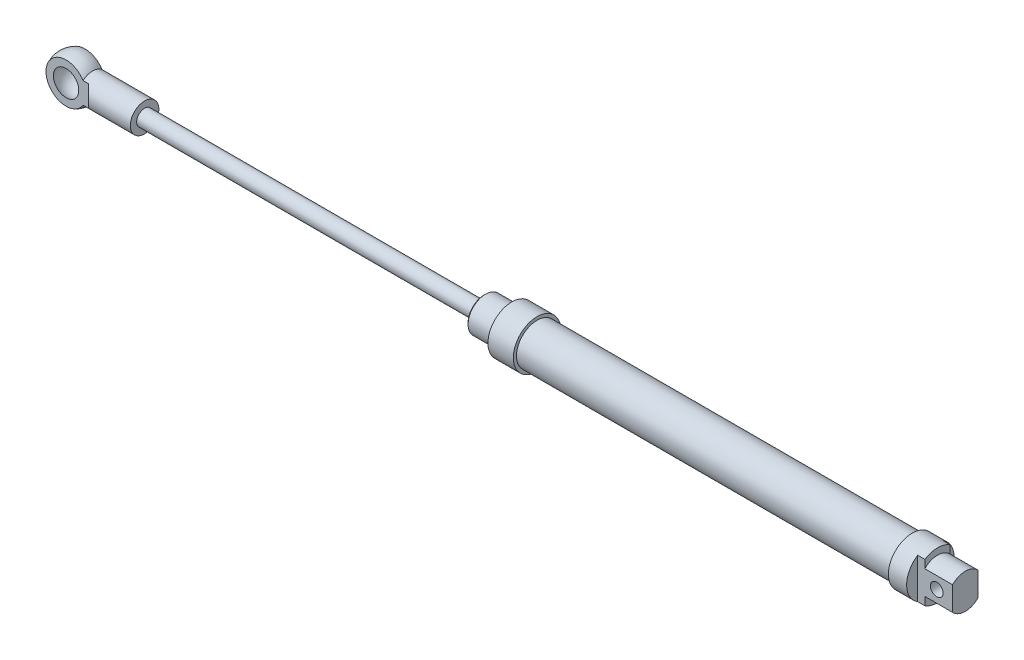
ISO-10303-21;
HEADER;
FILE_DESCRIPTION(('STEP AP214'),'2;1');
FILE_NAME('part.step','',(''),(''),'','','');
FILE_SCHEMA(('AUTOMOTIVE_DESIGN { 1 0 10303 214 1 1 1 1 }'));
ENDSEC;
DATA;
#1=APPLICATION_CONTEXT('core data for automotive mechanical design processes');
#2=APPLICATION_PROTOCOL_DEFINITION('international standard','automotive_design',2000,#1);
#3=PRODUCT_CONTEXT('',#1,'mechanical');
#4=PRODUCT('Part','Part','',(#3));
#5=PRODUCT_RELATED_PRODUCT_CATEGORY('part','',(#4));
#6=PRODUCT_DEFINITION_FORMATION('','',#4);
#7=PRODUCT_DEFINITION_CONTEXT('part definition',#1,'design');
#8=PRODUCT_DEFINITION('design','',#6,#7);
#9=PRODUCT_DEFINITION_SHAPE('','',#8);
#10=(LENGTH_UNIT() NAMED_UNIT(*) SI_UNIT(.MILLI.,.METRE.));
#11=(NAMED_UNIT(*) PLANE_ANGLE_UNIT() SI_UNIT($,.RADIAN.));
#12=(NAMED_UNIT(*) SI_UNIT($,.STERADIAN.) SOLID_ANGLE_UNIT());
#13=UNCERTAINTY_MEASURE_WITH_UNIT(LENGTH_MEASURE(1.E-05),#10,'distance_accuracy_value','');
#14=(GEOMETRIC_REPRESENTATION_CONTEXT(3) GLOBAL_UNCERTAINTY_ASSIGNED_CONTEXT((#13)) GLOBAL_UNIT_ASSIGNED_CONTEXT((#10,
#11,#12)) REPRESENTATION_CONTEXT('',''));
#15=CARTESIAN_POINT('',(0.,0.,0.));
#16=DIRECTION('',(0.,0.,1.));
#17=DIRECTION('',(1.,0.,0.));
#18=AXIS2_PLACEMENT_3D('',#15,#16,#17);
#19=CARTESIAN_POINT('',(286.,15.,0.));
#20=DIRECTION('',(1.,0.,0.));
#21=DIRECTION('',(0.,1.,0.));
#22=AXIS2_PLACEMENT_3D('',#19,#20,#21);
#23=PLANE('',#22);
#24=DIRECTION('',(0.,1.,0.));
#25=VECTOR('',#24,1.);
#26=CARTESIAN_POINT('',(286.,15.,8.));
#27=LINE('',#26,#25);
#28=CARTESIAN_POINT('',(286.,-12.6885775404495,8.));
#29=VERTEX_POINT('',#28);
#30=CARTESIAN_POINT('',(286.,-7.54983443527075,8.));
#31=VERTEX_POINT('',#30);
#32=EDGE_CURVE('E171',#29,#31,#27,.T.);
#33=ORIENTED_EDGE('',*,*,#32,.F.);
#34=CARTESIAN_POINT('',(286.,0.,0.));
#35=DIRECTION('',(1.,0.,0.));
#36=DIRECTION('',(0.,1.,0.));
#37=AXIS2_PLACEMENT_3D('',#34,#35,#36);
#38=CIRCLE('',#37,15.);
#39=CARTESIAN_POINT('',(286.,-12.6885775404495,-8.));
#40=VERTEX_POINT('',#39);
#41=EDGE_CURVE('E220',#29,#40,#38,.T.);
#42=ORIENTED_EDGE('',*,*,#41,.T.);
#43=DIRECTION('',(0.,-1.,0.));
#44=VECTOR('',#43,1.);
#45=CARTESIAN_POINT('',(286.,15.,-8.));
#46=LINE('',#45,#44);
#47=CARTESIAN_POINT('',(286.,-7.54983443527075,-8.));
#48=VERTEX_POINT('',#47);
#49=EDGE_CURVE('E187',#48,#40,#46,.T.);
#50=ORIENTED_EDGE('',*,*,#49,.F.);
#51=CARTESIAN_POINT('',(286.,0.,0.));
#52=DIRECTION('',(1.,0.,0.));
#53=DIRECTION('',(0.,1.,0.));
#54=AXIS2_PLACEMENT_3D('',#51,#52,#53);
#55=CIRCLE('',#54,11.);
#56=EDGE_CURVE('E191',#31,#48,#55,.T.);
#57=ORIENTED_EDGE('',*,*,#56,.F.);
#58=EDGE_LOOP('',(#33,#42,#50,#57));
#59=FACE_BOUND('',#58,.T.);
#60=ADVANCED_FACE('F28',(#59),#23,.T.);
#61=CARTESIAN_POINT('',(303.5,0.,0.));
#62=DIRECTION('',(1.,0.,0.));
#63=DIRECTION('',(0.,1.,0.));
#64=AXIS2_PLACEMENT_3D('',#61,#62,#63);
#65=CYLINDRICAL_SURFACE('',#64,11.);
#66=DIRECTION('',(1.,0.,0.));
#67=VECTOR('',#66,1.);
#68=CARTESIAN_POINT('',(303.5,7.54983443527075,8.));
#69=LINE('',#68,#67);
#70=CARTESIAN_POINT('',(303.5,7.54983443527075,8.));
#71=VERTEX_POINT('',#70);
#72=CARTESIAN_POINT('',(286.,7.54983443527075,8.));
#73=VERTEX_POINT('',#72);
#74=EDGE_CURVE('E233',#71,#73,#69,.F.);
#75=ORIENTED_EDGE('',*,*,#74,.F.);
#76=CARTESIAN_POINT('',(303.5,0.,0.));
#77=DIRECTION('',(1.,0.,0.));
#78=DIRECTION('',(0.,1.,0.));
#79=AXIS2_PLACEMENT_3D('',#76,#77,#78);
#80=CIRCLE('',#79,11.);
#81=CARTESIAN_POINT('',(303.5,7.54983443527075,-8.));
#82=VERTEX_POINT('',#81);
#83=EDGE_CURVE('E196',#82,#71,#80,.T.);
#84=ORIENTED_EDGE('',*,*,#83,.F.);
#85=DIRECTION('',(1.,0.,0.));
#86=VECTOR('',#85,1.);
#87=CARTESIAN_POINT('',(303.5,7.54983443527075,-8.));
#88=LINE('',#87,#86);
#89=CARTESIAN_POINT('',(286.,7.54983443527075,-8.));
#90=VERTEX_POINT('',#89);
#91=EDGE_CURVE('E224',#90,#82,#88,.T.);
#92=ORIENTED_EDGE('',*,*,#91,.F.);
#93=EDGE_CURVE('E192',#90,#73,#55,.T.);
#94=ORIENTED_EDGE('',*,*,#93,.T.);
#95=EDGE_LOOP('',(#75,#84,#92,#94));
#96=FACE_BOUND('',#95,.T.);
#97=ADVANCED_FACE('F263',(#96),#65,.T.);
#98=CARTESIAN_POINT('',(286.,12.6885775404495,8.));
#99=VERTEX_POINT('',#98);
#100=EDGE_CURVE('E174',#73,#99,#27,.T.);
#101=ORIENTED_EDGE('',*,*,#100,.F.);
#102=ORIENTED_EDGE('',*,*,#93,.F.);
#103=CARTESIAN_POINT('',(286.,12.6885775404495,-8.));
#104=VERTEX_POINT('',#103);
#105=EDGE_CURVE('E184',#104,#90,#46,.T.);
#106=ORIENTED_EDGE('',*,*,#105,.F.);
#107=EDGE_CURVE('E221',#104,#99,#38,.T.);
#108=ORIENTED_EDGE('',*,*,#107,.T.);
#109=EDGE_LOOP('',(#101,#102,#106,#108));
#110=FACE_BOUND('',#109,.T.);
#111=ADVANCED_FACE('F30',(#110),#23,.T.);
#112=CARTESIAN_POINT('',(303.5,0.,0.));
#113=DIRECTION('',(1.,0.,0.));
#114=DIRECTION('',(0.,1.,0.));
#115=AXIS2_PLACEMENT_3D('',#112,#113,#114);
#116=CYLINDRICAL_SURFACE('',#115,15.);
#117=DIRECTION('',(1.,0.,0.));
#118=VECTOR('',#117,1.);
#119=CARTESIAN_POINT('',(303.5,12.6885775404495,8.));
#120=LINE('',#119,#118);
#121=CARTESIAN_POINT('',(281.5,12.6885775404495,8.));
#122=VERTEX_POINT('',#121);
#123=EDGE_CURVE('E176',#99,#122,#120,.F.);
#124=ORIENTED_EDGE('',*,*,#123,.F.);
#125=ORIENTED_EDGE('',*,*,#107,.F.);
#126=DIRECTION('',(1.,0.,0.));
#127=VECTOR('',#126,1.);
#128=CARTESIAN_POINT('',(303.5,12.6885775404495,-8.));
#129=LINE('',#128,#127);
#130=CARTESIAN_POINT('',(281.5,12.6885775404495,-8.));
#131=VERTEX_POINT('',#130);
#132=EDGE_CURVE('E186',#131,#104,#129,.T.);
#133=ORIENTED_EDGE('',*,*,#132,.F.);
#134=CARTESIAN_POINT('',(281.5,0.,0.));
#135=DIRECTION('',(-1.,0.,0.));
#136=DIRECTION('',(0.,0.,1.));
#137=AXIS2_PLACEMENT_3D('',#134,#135,#136);
#138=CIRCLE('',#137,15.);
#139=CARTESIAN_POINT('',(281.5,-12.6885775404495,-8.));
#140=VERTEX_POINT('',#139);
#141=EDGE_CURVE('E229',#140,#131,#138,.F.);
#142=ORIENTED_EDGE('',*,*,#141,.F.);
#143=DIRECTION('',(1.,0.,0.));
#144=VECTOR('',#143,1.);
#145=CARTESIAN_POINT('',(303.5,-12.6885775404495,-8.));
#146=LINE('',#145,#144);
#147=EDGE_CURVE('E189',#40,#140,#146,.F.);
#148=ORIENTED_EDGE('',*,*,#147,.F.);
#149=ORIENTED_EDGE('',*,*,#41,.F.);
#150=DIRECTION('',(1.,0.,0.));
#151=VECTOR('',#150,1.);
#152=CARTESIAN_POINT('',(303.5,-12.6885775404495,8.));
#153=LINE('',#152,#151);
#154=CARTESIAN_POINT('',(281.5,-12.6885775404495,8.));
#155=VERTEX_POINT('',#154);
#156=EDGE_CURVE('E173',#155,#29,#153,.T.);
#157=ORIENTED_EDGE('',*,*,#156,.F.);
#158=CARTESIAN_POINT('',(281.5,0.,0.));
#159=DIRECTION('',(-1.,0.,0.));
#160=DIRECTION('',(0.,0.,1.));
#161=AXIS2_PLACEMENT_3D('',#158,#159,#160);
#162=CIRCLE('',#161,15.);
#163=EDGE_CURVE('E235',#122,#155,#162,.F.);
#164=ORIENTED_EDGE('',*,*,#163,.F.);
#165=EDGE_LOOP('',(#124,#125,#133,#142,#148,#149,#157,#164));
#166=FACE_BOUND('',#165,.T.);
#167=CARTESIAN_POINT('',(270.,0.,0.));
#168=DIRECTION('',(1.,0.,0.));
#169=DIRECTION('',(0.,1.,0.));
#170=AXIS2_PLACEMENT_3D('',#167,#168,#169);
#171=CIRCLE('',#170,15.);
#172=CARTESIAN_POINT('',(270.,15.,0.));
#173=VERTEX_POINT('',#172);
#174=EDGE_CURVE('E217',#173,#173,#171,.T.);
#175=ORIENTED_EDGE('',*,*,#174,.T.);
#176=EDGE_LOOP('',(#175));
#177=FACE_BOUND('',#176,.T.);
#178=ADVANCED_FACE('F274',(#166,#177),#116,.T.);
#179=CARTESIAN_POINT('',(270.,13.,0.));
#180=DIRECTION('',(-1.,0.,0.));
#181=DIRECTION('',(0.,-1.,0.));
#182=AXIS2_PLACEMENT_3D('',#179,#180,#181);
#183=PLANE('',#182);
#184=CARTESIAN_POINT('',(270.,0.,0.));
#185=DIRECTION('',(1.,0.,0.));
#186=DIRECTION('',(0.,1.,0.));
#187=AXIS2_PLACEMENT_3D('',#184,#185,#186);
#188=CIRCLE('',#187,13.);
#189=CARTESIAN_POINT('',(270.,13.,0.));
#190=VERTEX_POINT('',#189);
#191=EDGE_CURVE('E214',#190,#190,#188,.T.);
#192=ORIENTED_EDGE('',*,*,#191,.T.);
#193=EDGE_LOOP('',(#192));
#194=FACE_BOUND('',#193,.T.);
#195=ORIENTED_EDGE('',*,*,#174,.F.);
#196=EDGE_LOOP('',(#195));
#197=FACE_BOUND('',#196,.T.);
#198=ADVANCED_FACE('F279',(#194,#197),#183,.T.);
#199=CARTESIAN_POINT('',(303.5,0.,0.));
#200=DIRECTION('',(1.,0.,0.));
#201=DIRECTION('',(0.,1.,0.));
#202=AXIS2_PLACEMENT_3D('',#199,#200,#201);
#203=CYLINDRICAL_SURFACE('',#202,13.);
#204=CARTESIAN_POINT('',(33.5,0.,0.));
#205=DIRECTION('',(1.,0.,0.));
#206=DIRECTION('',(0.,1.,0.));
#207=AXIS2_PLACEMENT_3D('',#204,#205,#206);
#208=CIRCLE('',#207,13.);
#209=CARTESIAN_POINT('',(33.5,13.,0.));
#210=VERTEX_POINT('',#209);
#211=EDGE_CURVE('E211',#210,#210,#208,.T.);
#212=ORIENTED_EDGE('',*,*,#211,.T.);
#213=EDGE_LOOP('',(#212));
#214=FACE_BOUND('',#213,.T.);
#215=ORIENTED_EDGE('',*,*,#191,.F.);
#216=EDGE_LOOP('',(#215));
#217=FACE_BOUND('',#216,.T.);
#218=ADVANCED_FACE('F349',(#214,#217),#203,.T.);
#219=CARTESIAN_POINT('',(33.5,15.,0.));
#220=DIRECTION('',(1.,0.,0.));
#221=DIRECTION('',(0.,1.,0.));
#222=AXIS2_PLACEMENT_3D('',#219,#220,#221);
#223=PLANE('',#222);
#224=CARTESIAN_POINT('',(33.5,0.,0.));
#225=DIRECTION('',(1.,0.,0.));
#226=DIRECTION('',(0.,1.,0.));
#227=AXIS2_PLACEMENT_3D('',#224,#225,#226);
#228=CIRCLE('',#227,15.);
#229=CARTESIAN_POINT('',(33.5,15.,0.));
#230=VERTEX_POINT('',#229);
#231=EDGE_CURVE('E208',#230,#230,#228,.T.);
#232=ORIENTED_EDGE('',*,*,#231,.T.);
#233=EDGE_LOOP('',(#232));
#234=FACE_BOUND('',#233,.T.);
#235=ORIENTED_EDGE('',*,*,#211,.F.);
#236=EDGE_LOOP('',(#235));
#237=FACE_BOUND('',#236,.T.);
#238=ADVANCED_FACE('F345',(#234,#237),#223,.T.);
#239=CARTESIAN_POINT('',(303.5,0.,0.));
#240=DIRECTION('',(1.,0.,0.));
#241=DIRECTION('',(0.,1.,0.));
#242=AXIS2_PLACEMENT_3D('',#239,#240,#241);
#243=CYLINDRICAL_SURFACE('',#242,15.);
#244=CARTESIAN_POINT('',(17.5,0.,0.));
#245=DIRECTION('',(1.,0.,0.));
#246=DIRECTION('',(0.,1.,0.));
#247=AXIS2_PLACEMENT_3D('',#244,#245,#246);
#248=CIRCLE('',#247,15.);
#249=CARTESIAN_POINT('',(17.5,15.,0.));
#250=VERTEX_POINT('',#249);
#251=EDGE_CURVE('E205',#250,#250,#248,.T.);
#252=ORIENTED_EDGE('',*,*,#251,.T.);
#253=EDGE_LOOP('',(#252));
#254=FACE_BOUND('',#253,.T.);
#255=ORIENTED_EDGE('',*,*,#231,.F.);
#256=EDGE_LOOP('',(#255));
#257=FACE_BOUND('',#256,.T.);
#258=ADVANCED_FACE('F341',(#254,#257),#243,.T.);
#259=CARTESIAN_POINT('',(17.5,11.,0.));
#260=DIRECTION('',(-1.,0.,0.));
#261=DIRECTION('',(0.,-1.,0.));
#262=AXIS2_PLACEMENT_3D('',#259,#260,#261);
#263=PLANE('',#262);
#264=CARTESIAN_POINT('',(17.5,0.,0.));
#265=DIRECTION('',(1.,0.,0.));
#266=DIRECTION('',(0.,1.,0.));
#267=AXIS2_PLACEMENT_3D('',#264,#265,#266);
#268=CIRCLE('',#267,11.);
#269=CARTESIAN_POINT('',(17.5,11.,0.));
#270=VERTEX_POINT('',#269);
#271=EDGE_CURVE('E202',#270,#270,#268,.T.);
#272=ORIENTED_EDGE('',*,*,#271,.T.);
#273=EDGE_LOOP('',(#272));
#274=FACE_BOUND('',#273,.T.);
#275=ORIENTED_EDGE('',*,*,#251,.F.);
#276=EDGE_LOOP('',(#275));
#277=FACE_BOUND('',#276,.T.);
#278=ADVANCED_FACE('F338',(#274,#277),#263,.T.);
#279=CARTESIAN_POINT('',(303.5,0.,0.));
#280=DIRECTION('',(1.,0.,0.));
#281=DIRECTION('',(0.,1.,0.));
#282=AXIS2_PLACEMENT_3D('',#279,#280,#281);
#283=CYLINDRICAL_SURFACE('',#282,11.);
#284=CARTESIAN_POINT('',(1.,0.,0.));
#285=DIRECTION('',(-1.,0.,0.));
#286=DIRECTION('',(0.,-1.,0.));
#287=AXIS2_PLACEMENT_3D('',#284,#285,#286);
#288=CIRCLE('',#287,11.);
#289=CARTESIAN_POINT('',(1.,-11.,0.));
#290=VERTEX_POINT('',#289);
#291=EDGE_CURVE('E36',#290,#290,#288,.F.);
#292=ORIENTED_EDGE('',*,*,#291,.T.);
#293=EDGE_LOOP('',(#292));
#294=FACE_BOUND('',#293,.T.);
#295=ORIENTED_EDGE('',*,*,#271,.F.);
#296=EDGE_LOOP('',(#295));
#297=FACE_BOUND('',#296,.T.);
#298=ADVANCED_FACE('F334',(#294,#297),#283,.T.);
#299=CARTESIAN_POINT('',(0.,4.99999999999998,0.));
#300=DIRECTION('',(-1.,0.,0.));
#301=DIRECTION('',(0.,-1.,0.));
#302=AXIS2_PLACEMENT_3D('',#299,#300,#301);
#303=PLANE('',#302);
#304=CARTESIAN_POINT('',(0.,0.,0.));
#305=DIRECTION('',(-1.,0.,0.));
#306=DIRECTION('',(0.,-1.,0.));
#307=AXIS2_PLACEMENT_3D('',#304,#305,#306);
#308=CIRCLE('',#307,9.99999999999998);
#309=CARTESIAN_POINT('',(0.,-9.99999999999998,0.));
#310=VERTEX_POINT('',#309);
#311=EDGE_CURVE('E11',#310,#310,#308,.T.);
#312=ORIENTED_EDGE('',*,*,#311,.T.);
#313=EDGE_LOOP('',(#312));
#314=FACE_BOUND('',#313,.T.);
#315=CARTESIAN_POINT('',(0.,0.,0.));
#316=DIRECTION('',(1.,0.,0.));
#317=DIRECTION('',(0.,1.,0.));
#318=AXIS2_PLACEMENT_3D('',#315,#316,#317);
#319=CIRCLE('',#318,4.99999999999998);
#320=CARTESIAN_POINT('',(0.,4.99999999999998,0.));
#321=VERTEX_POINT('',#320);
#322=EDGE_CURVE('E199',#321,#321,#319,.T.);
#323=ORIENTED_EDGE('',*,*,#322,.T.);
#324=EDGE_LOOP('',(#323));
#325=FACE_BOUND('',#324,.T.);
#326=ADVANCED_FACE('F330',(#314,#325),#303,.T.);
#327=CARTESIAN_POINT('',(303.5,0.,0.));
#328=DIRECTION('',(1.,0.,0.));
#329=DIRECTION('',(0.,1.,0.));
#330=AXIS2_PLACEMENT_3D('',#327,#328,#329);
#331=CYLINDRICAL_SURFACE('',#330,4.99999999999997);
#332=CARTESIAN_POINT('',(-214.,0.,0.));
#333=DIRECTION('',(1.,0.,0.));
#334=DIRECTION('',(0.,0.,-1.));
#335=AXIS2_PLACEMENT_3D('',#332,#333,#334);
#336=CIRCLE('',#335,4.99999999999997);
#337=CARTESIAN_POINT('',(-214.,0.,-4.99999999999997));
#338=VERTEX_POINT('',#337);
#339=EDGE_CURVE('E237',#338,#338,#336,.F.);
#340=ORIENTED_EDGE('',*,*,#339,.F.);
#341=EDGE_LOOP('',(#340));
#342=FACE_BOUND('',#341,.T.);
#343=ORIENTED_EDGE('',*,*,#322,.F.);
#344=EDGE_LOOP('',(#343));
#345=FACE_BOUND('',#344,.T.);
#346=ADVANCED_FACE('F327',(#342,#345),#331,.T.);
#347=CARTESIAN_POINT('',(303.5,11.,0.));
#348=DIRECTION('',(1.,0.,0.));
#349=DIRECTION('',(0.,1.,0.));
#350=AXIS2_PLACEMENT_3D('',#347,#348,#349);
#351=PLANE('',#350);
#352=DIRECTION('',(0.,1.,0.));
#353=VECTOR('',#352,1.);
#354=CARTESIAN_POINT('',(303.5,11.,8.));
#355=LINE('',#354,#353);
#356=CARTESIAN_POINT('',(303.5,-7.54983443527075,8.));
#357=VERTEX_POINT('',#356);
#358=EDGE_CURVE('E169',#357,#71,#355,.T.);
#359=ORIENTED_EDGE('',*,*,#358,.F.);
#360=CARTESIAN_POINT('',(303.5,-7.54983443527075,-8.));
#361=VERTEX_POINT('',#360);
#362=EDGE_CURVE('E195',#357,#361,#80,.T.);
#363=ORIENTED_EDGE('',*,*,#362,.T.);
#364=DIRECTION('',(0.,-1.,0.));
#365=VECTOR('',#364,1.);
#366=CARTESIAN_POINT('',(303.5,11.,-8.));
#367=LINE('',#366,#365);
#368=EDGE_CURVE('E181',#82,#361,#367,.T.);
#369=ORIENTED_EDGE('',*,*,#368,.F.);
#370=ORIENTED_EDGE('',*,*,#83,.T.);
#371=EDGE_LOOP('',(#359,#363,#369,#370));
#372=FACE_BOUND('',#371,.T.);
#373=ADVANCED_FACE('F296',(#372),#351,.T.);
#374=DIRECTION('',(1.,0.,0.));
#375=VECTOR('',#374,1.);
#376=CARTESIAN_POINT('',(303.5,-7.54983443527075,8.));
#377=LINE('',#376,#375);
#378=EDGE_CURVE('E231',#31,#357,#377,.T.);
#379=ORIENTED_EDGE('',*,*,#378,.F.);
#380=ORIENTED_EDGE('',*,*,#56,.T.);
#381=DIRECTION('',(1.,0.,0.));
#382=VECTOR('',#381,1.);
#383=CARTESIAN_POINT('',(303.5,-7.54983443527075,-8.));
#384=LINE('',#383,#382);
#385=EDGE_CURVE('E226',#361,#48,#384,.F.);
#386=ORIENTED_EDGE('',*,*,#385,.F.);
#387=ORIENTED_EDGE('',*,*,#362,.F.);
#388=EDGE_LOOP('',(#379,#380,#386,#387));
#389=FACE_BOUND('',#388,.T.);
#390=ADVANCED_FACE('F271',(#389),#65,.T.);
#391=CARTESIAN_POINT('',(281.5,-15.,-18.8959301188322));
#392=DIRECTION('',(-1.,0.,0.));
#393=DIRECTION('',(0.,0.,1.));
#394=AXIS2_PLACEMENT_3D('',#391,#392,#393);
#395=PLANE('',#394);
#396=ORIENTED_EDGE('',*,*,#141,.T.);
#397=DIRECTION('',(0.,1.,0.));
#398=VECTOR('',#397,1.);
#399=CARTESIAN_POINT('',(281.5,-15.,-8.));
#400=LINE('',#399,#398);
#401=EDGE_CURVE('E178',#140,#131,#400,.T.);
#402=ORIENTED_EDGE('',*,*,#401,.F.);
#403=EDGE_LOOP('',(#396,#402));
#404=FACE_BOUND('',#403,.T.);
#405=ADVANCED_FACE('F312',(#404),#395,.F.);
#406=CARTESIAN_POINT('',(281.5,-15.,-8.));
#407=DIRECTION('',(0.,0.,1.));
#408=DIRECTION('',(1.,0.,0.));
#409=AXIS2_PLACEMENT_3D('',#406,#407,#408);
#410=PLANE('',#409);
#411=CARTESIAN_POINT('',(293.5,0.,-8.));
#412=DIRECTION('',(0.,0.,1.));
#413=DIRECTION('',(1.,0.,0.));
#414=AXIS2_PLACEMENT_3D('',#411,#412,#413);
#415=CIRCLE('',#414,3.99999999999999);
#416=CARTESIAN_POINT('',(297.5,0.,-8.));
#417=VERTEX_POINT('',#416);
#418=EDGE_CURVE('E163',#417,#417,#415,.T.);
#419=ORIENTED_EDGE('',*,*,#418,.T.);
#420=EDGE_LOOP('',(#419));
#421=FACE_BOUND('',#420,.T.);
#422=ORIENTED_EDGE('',*,*,#147,.T.);
#423=ORIENTED_EDGE('',*,*,#401,.T.);
#424=ORIENTED_EDGE('',*,*,#132,.T.);
#425=ORIENTED_EDGE('',*,*,#105,.T.);
#426=ORIENTED_EDGE('',*,*,#91,.T.);
#427=ORIENTED_EDGE('',*,*,#368,.T.);
#428=ORIENTED_EDGE('',*,*,#385,.T.);
#429=ORIENTED_EDGE('',*,*,#49,.T.);
#430=EDGE_LOOP('',(#422,#423,#424,#425,#426,#427,#428,#429));
#431=FACE_BOUND('',#430,.T.);
#432=ADVANCED_FACE('F292',(#421,#431),#410,.F.);
#433=CARTESIAN_POINT('',(281.5,-15.,18.8959301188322));
#434=DIRECTION('',(-1.,0.,0.));
#435=DIRECTION('',(0.,0.,1.));
#436=AXIS2_PLACEMENT_3D('',#433,#434,#435);
#437=PLANE('',#436);
#438=ORIENTED_EDGE('',*,*,#163,.T.);
#439=DIRECTION('',(0.,1.,0.));
#440=VECTOR('',#439,1.);
#441=CARTESIAN_POINT('',(281.5,-15.,8.));
#442=LINE('',#441,#440);
#443=EDGE_CURVE('E166',#155,#122,#442,.T.);
#444=ORIENTED_EDGE('',*,*,#443,.T.);
#445=EDGE_LOOP('',(#438,#444));
#446=FACE_BOUND('',#445,.T.);
#447=ADVANCED_FACE('F320',(#446),#437,.F.);
#448=CARTESIAN_POINT('',(281.5,-15.,8.));
#449=DIRECTION('',(0.,0.,-1.));
#450=DIRECTION('',(-1.,0.,0.));
#451=AXIS2_PLACEMENT_3D('',#448,#449,#450);
#452=PLANE('',#451);
#453=CARTESIAN_POINT('',(293.5,0.,8.));
#454=DIRECTION('',(0.,0.,1.));
#455=DIRECTION('',(1.,0.,0.));
#456=AXIS2_PLACEMENT_3D('',#453,#454,#455);
#457=CIRCLE('',#456,3.99999999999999);
#458=CARTESIAN_POINT('',(297.5,0.,8.));
#459=VERTEX_POINT('',#458);
#460=EDGE_CURVE('E160',#459,#459,#457,.T.);
#461=ORIENTED_EDGE('',*,*,#460,.F.);
#462=EDGE_LOOP('',(#461));
#463=FACE_BOUND('',#462,.T.);
#464=ORIENTED_EDGE('',*,*,#123,.T.);
#465=ORIENTED_EDGE('',*,*,#443,.F.);
#466=ORIENTED_EDGE('',*,*,#156,.T.);
#467=ORIENTED_EDGE('',*,*,#32,.T.);
#468=ORIENTED_EDGE('',*,*,#378,.T.);
#469=ORIENTED_EDGE('',*,*,#358,.T.);
#470=ORIENTED_EDGE('',*,*,#74,.T.);
#471=ORIENTED_EDGE('',*,*,#100,.T.);
#472=EDGE_LOOP('',(#464,#465,#466,#467,#468,#469,#470,#471));
#473=FACE_BOUND('',#472,.T.);
#474=ADVANCED_FACE('F422',(#463,#473),#452,.F.);
#475=CARTESIAN_POINT('',(293.5,0.,-15.));
#476=DIRECTION('',(0.,0.,1.));
#477=DIRECTION('',(1.,0.,0.));
#478=AXIS2_PLACEMENT_3D('',#475,#476,#477);
#479=CYLINDRICAL_SURFACE('',#478,3.99999999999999);
#480=ORIENTED_EDGE('',*,*,#460,.T.);
#481=EDGE_LOOP('',(#480));
#482=FACE_BOUND('',#481,.T.);
#483=ORIENTED_EDGE('',*,*,#418,.F.);
#484=EDGE_LOOP('',(#483));
#485=FACE_BOUND('',#484,.T.);
#486=ADVANCED_FACE('F429',(#482,#485),#479,.F.);
#487=CARTESIAN_POINT('',(-214.,8.99999999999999,0.));
#488=DIRECTION('',(1.,0.,0.));
#489=DIRECTION('',(0.,0.,-1.));
#490=AXIS2_PLACEMENT_3D('',#487,#488,#489);
#491=PLANE('',#490);
#492=ORIENTED_EDGE('',*,*,#339,.T.);
#493=EDGE_LOOP('',(#492));
#494=FACE_BOUND('',#493,.T.);
#495=CARTESIAN_POINT('',(-214.,0.,0.));
#496=DIRECTION('',(1.,0.,0.));
#497=DIRECTION('',(0.,0.,-1.));
#498=AXIS2_PLACEMENT_3D('',#495,#496,#497);
#499=CIRCLE('',#498,8.99999999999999);
#500=CARTESIAN_POINT('',(-214.,0.,-8.99999999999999));
#501=VERTEX_POINT('',#500);
#502=EDGE_CURVE('E157',#501,#501,#499,.T.);
#503=ORIENTED_EDGE('',*,*,#502,.T.);
#504=EDGE_LOOP('',(#503));
#505=FACE_BOUND('',#504,.T.);
#506=ADVANCED_FACE('F259',(#494,#505),#491,.T.);
#507=CARTESIAN_POINT('',(-199.414867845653,0.,0.));
#508=DIRECTION('',(1.,0.,0.));
#509=DIRECTION('',(0.,0.,-1.));
#510=AXIS2_PLACEMENT_3D('',#507,#508,#509);
#511=CYLINDRICAL_SURFACE('',#510,8.99999999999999);
#512=DIRECTION('',(1.,0.,0.));
#513=VECTOR('',#512,1.);
#514=CARTESIAN_POINT('',(-199.414867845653,6.70820393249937,5.99999999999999));
#515=LINE('',#514,#513);
#516=CARTESIAN_POINT('',(-243.4,6.70820393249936,5.99999999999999));
#517=VERTEX_POINT('',#516);
#518=CARTESIAN_POINT('',(-246.776194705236,6.70820393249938,5.99999999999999));
#519=VERTEX_POINT('',#518);
#520=EDGE_CURVE('E43',#517,#519,#515,.F.);
#521=ORIENTED_EDGE('',*,*,#520,.F.);
#522=CARTESIAN_POINT('',(-249.4,0.,0.));
#523=DIRECTION('',(0.707106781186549,0.,-0.707106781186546));
#524=DIRECTION('',(0.707106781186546,0.,0.707106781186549));
#525=AXIS2_PLACEMENT_3D('',#522,#523,#524);
#526=ELLIPSE('',#525,12.7279220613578,8.99999999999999);
#527=CARTESIAN_POINT('',(-243.4,-6.70820393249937,5.99999999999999));
#528=VERTEX_POINT('',#527);
#529=EDGE_CURVE('E126',#528,#517,#526,.F.);
#530=ORIENTED_EDGE('',*,*,#529,.F.);
#531=DIRECTION('',(1.,0.,0.));
#532=VECTOR('',#531,1.);
#533=CARTESIAN_POINT('',(-199.414867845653,-6.70820393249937,5.99999999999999));
#534=LINE('',#533,#532);
#535=CARTESIAN_POINT('',(-246.776194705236,-6.70820393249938,5.99999999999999));
#536=VERTEX_POINT('',#535);
#537=EDGE_CURVE('E117',#536,#528,#534,.T.);
#538=ORIENTED_EDGE('',*,*,#537,.F.);
#539=CARTESIAN_POINT('',(-246.776194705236,0.,0.));
#540=DIRECTION('',(1.,0.,0.));
#541=DIRECTION('',(0.,0.,-1.));
#542=AXIS2_PLACEMENT_3D('',#539,#540,#541);
#543=CIRCLE('',#542,9.);
#544=CARTESIAN_POINT('',(-246.776194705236,-6.70820393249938,-5.99999999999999));
#545=VERTEX_POINT('',#544);
#546=EDGE_CURVE('E51',#536,#545,#543,.T.);
#547=ORIENTED_EDGE('',*,*,#546,.T.);
#548=DIRECTION('',(1.,0.,0.));
#549=VECTOR('',#548,1.);
#550=CARTESIAN_POINT('',(-199.414867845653,-6.70820393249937,-5.99999999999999));
#551=LINE('',#550,#549);
#552=CARTESIAN_POINT('',(-243.4,-6.70820393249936,-5.99999999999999));
#553=VERTEX_POINT('',#552);
#554=EDGE_CURVE('E153',#553,#545,#551,.F.);
#555=ORIENTED_EDGE('',*,*,#554,.F.);
#556=CARTESIAN_POINT('',(-249.4,0.,0.));
#557=DIRECTION('',(0.707106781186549,0.,0.707106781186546));
#558=DIRECTION('',(0.707106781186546,0.,-0.707106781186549));
#559=AXIS2_PLACEMENT_3D('',#556,#557,#558);
#560=ELLIPSE('',#559,12.7279220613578,8.99999999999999);
#561=CARTESIAN_POINT('',(-243.4,6.70820393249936,-5.99999999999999));
#562=VERTEX_POINT('',#561);
#563=EDGE_CURVE('E134',#562,#553,#560,.F.);
#564=ORIENTED_EDGE('',*,*,#563,.F.);
#565=DIRECTION('',(1.,0.,0.));
#566=VECTOR('',#565,1.);
#567=CARTESIAN_POINT('',(-199.414867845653,6.70820393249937,-5.99999999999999));
#568=LINE('',#567,#566);
#569=CARTESIAN_POINT('',(-246.776194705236,6.70820393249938,-5.99999999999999));
#570=VERTEX_POINT('',#569);
#571=EDGE_CURVE('E151',#570,#562,#568,.T.);
#572=ORIENTED_EDGE('',*,*,#571,.F.);
#573=EDGE_CURVE('E155',#570,#519,#543,.T.);
#574=ORIENTED_EDGE('',*,*,#573,.T.);
#575=EDGE_LOOP('',(#521,#530,#538,#547,#555,#564,#572,#574));
#576=FACE_BOUND('',#575,.T.);
#577=ORIENTED_EDGE('',*,*,#502,.F.);
#578=EDGE_LOOP('',(#577));
#579=FACE_BOUND('',#578,.T.);
#580=ADVANCED_FACE('F129',(#576,#579),#511,.T.);
#581=CARTESIAN_POINT('',(-257.5,0.,0.));
#582=DIRECTION('',(1.,0.,0.));
#583=DIRECTION('',(0.,1.,0.));
#584=AXIS2_PLACEMENT_3D('',#581,#582,#583);
#585=SPHERICAL_SURFACE('',#584,14.);
#586=CARTESIAN_POINT('',(-257.5,0.,5.99999999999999));
#587=DIRECTION('',(0.,0.,-1.));
#588=DIRECTION('',(-1.,0.,0.));
#589=AXIS2_PLACEMENT_3D('',#586,#587,#588);
#590=CIRCLE('',#589,12.6491106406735);
#591=EDGE_CURVE('E121',#519,#536,#590,.F.);
#592=ORIENTED_EDGE('',*,*,#591,.F.);
#593=ORIENTED_EDGE('',*,*,#573,.F.);
#594=CARTESIAN_POINT('',(-257.5,0.,-5.99999999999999));
#595=DIRECTION('',(0.,0.,1.));
#596=DIRECTION('',(1.,0.,0.));
#597=AXIS2_PLACEMENT_3D('',#594,#595,#596);
#598=CIRCLE('',#597,12.6491106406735);
#599=EDGE_CURVE('E240',#545,#570,#598,.F.);
#600=ORIENTED_EDGE('',*,*,#599,.F.);
#601=ORIENTED_EDGE('',*,*,#546,.F.);
#602=EDGE_LOOP('',(#592,#593,#600,#601));
#603=FACE_BOUND('',#602,.T.);
#604=ADVANCED_FACE('F251',(#603),#585,.T.);
#605=CARTESIAN_POINT('',(-243.4,-15.,-5.99999999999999));
#606=DIRECTION('',(0.707106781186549,0.,0.707106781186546));
#607=DIRECTION('',(0.707106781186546,0.,-0.707106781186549));
#608=AXIS2_PLACEMENT_3D('',#605,#606,#607);
#609=PLANE('',#608);
#610=ORIENTED_EDGE('',*,*,#563,.T.);
#611=DIRECTION('',(0.,1.,0.));
#612=VECTOR('',#611,1.);
#613=CARTESIAN_POINT('',(-243.4,-15.,-5.99999999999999));
#614=LINE('',#613,#612);
#615=EDGE_CURVE('E148',#553,#562,#614,.T.);
#616=ORIENTED_EDGE('',*,*,#615,.T.);
#617=EDGE_LOOP('',(#610,#616));
#618=FACE_BOUND('',#617,.T.);
#619=ADVANCED_FACE('F244',(#618),#609,.F.);
#620=CARTESIAN_POINT('',(-277.549493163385,-15.,-5.99999999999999));
#621=DIRECTION('',(0.,0.,1.));
#622=DIRECTION('',(1.,0.,0.));
#623=AXIS2_PLACEMENT_3D('',#620,#621,#622);
#624=PLANE('',#623);
#625=CARTESIAN_POINT('',(-257.5,0.,-5.99999999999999));
#626=DIRECTION('',(0.,0.,1.));
#627=DIRECTION('',(1.,0.,0.));
#628=AXIS2_PLACEMENT_3D('',#625,#626,#627);
#629=CIRCLE('',#628,8.00000000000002);
#630=CARTESIAN_POINT('',(-249.5,0.,-5.99999999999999));
#631=VERTEX_POINT('',#630);
#632=EDGE_CURVE('E127',#631,#631,#629,.T.);
#633=ORIENTED_EDGE('',*,*,#632,.T.);
#634=EDGE_LOOP('',(#633));
#635=FACE_BOUND('',#634,.T.);
#636=ORIENTED_EDGE('',*,*,#554,.T.);
#637=ORIENTED_EDGE('',*,*,#599,.T.);
#638=ORIENTED_EDGE('',*,*,#571,.T.);
#639=ORIENTED_EDGE('',*,*,#615,.F.);
#640=EDGE_LOOP('',(#636,#637,#638,#639));
#641=FACE_BOUND('',#640,.T.);
#642=ADVANCED_FACE('F247',(#635,#641),#624,.F.);
#643=CARTESIAN_POINT('',(-277.549493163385,-15.,5.99999999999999));
#644=DIRECTION('',(0.,0.,-1.));
#645=DIRECTION('',(-1.,0.,0.));
#646=AXIS2_PLACEMENT_3D('',#643,#644,#645);
#647=PLANE('',#646);
#648=CARTESIAN_POINT('',(-257.5,0.,5.99999999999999));
#649=DIRECTION('',(0.,0.,-1.));
#650=DIRECTION('',(-1.,0.,0.));
#651=AXIS2_PLACEMENT_3D('',#648,#649,#650);
#652=CIRCLE('',#651,8.00000000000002);
#653=CARTESIAN_POINT('',(-265.5,0.,5.99999999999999));
#654=VERTEX_POINT('',#653);
#655=EDGE_CURVE('E138',#654,#654,#652,.T.);
#656=ORIENTED_EDGE('',*,*,#655,.T.);
#657=EDGE_LOOP('',(#656));
#658=FACE_BOUND('',#657,.T.);
#659=ORIENTED_EDGE('',*,*,#520,.T.);
#660=ORIENTED_EDGE('',*,*,#591,.T.);
#661=ORIENTED_EDGE('',*,*,#537,.T.);
#662=DIRECTION('',(0.,1.,0.));
#663=VECTOR('',#662,1.);
#664=CARTESIAN_POINT('',(-243.4,-15.,5.99999999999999));
#665=LINE('',#664,#663);
#666=EDGE_CURVE('E120',#528,#517,#665,.T.);
#667=ORIENTED_EDGE('',*,*,#666,.T.);
#668=EDGE_LOOP('',(#659,#660,#661,#667));
#669=FACE_BOUND('',#668,.T.);
#670=ADVANCED_FACE('F119',(#658,#669),#647,.F.);
#671=CARTESIAN_POINT('',(-243.4,-15.,5.99999999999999));
#672=DIRECTION('',(0.707106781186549,0.,-0.707106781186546));
#673=DIRECTION('',(-0.707106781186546,0.,-0.707106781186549));
#674=AXIS2_PLACEMENT_3D('',#671,#672,#673);
#675=PLANE('',#674);
#676=ORIENTED_EDGE('',*,*,#529,.T.);
#677=ORIENTED_EDGE('',*,*,#666,.F.);
#678=EDGE_LOOP('',(#676,#677));
#679=FACE_BOUND('',#678,.T.);
#680=ADVANCED_FACE('F125',(#679),#675,.F.);
#681=CARTESIAN_POINT('',(-257.5,0.,0.));
#682=DIRECTION('',(1.,0.,0.));
#683=DIRECTION('',(0.,1.,0.));
#684=AXIS2_PLACEMENT_3D('',#681,#682,#683);
#685=SPHERICAL_SURFACE('',#684,10.);
#686=CARTESIAN_POINT('',(-257.5,0.,0.));
#687=DIRECTION('',(0.,0.,-1.));
#688=DIRECTION('',(-1.,0.,0.));
#689=AXIS2_PLACEMENT_3D('',#686,#687,#688);
#690=SPHERICAL_SURFACE('',#689,10.);
#691=ORIENTED_EDGE('',*,*,#655,.F.);
#692=EDGE_LOOP('',(#691));
#693=FACE_BOUND('',#692,.T.);
#694=ORIENTED_EDGE('',*,*,#632,.F.);
#695=EDGE_LOOP('',(#694));
#696=FACE_BOUND('',#695,.T.);
#697=ADVANCED_FACE('F469',(#693,#696),#690,.F.);
#698=CARTESIAN_POINT('',(1.,0.,0.));
#699=DIRECTION('',(1.,0.,0.));
#700=DIRECTION('',(0.,1.,0.));
#701=AXIS2_PLACEMENT_3D('',#698,#699,#700);
#702=CONICAL_SURFACE('',#701,11.,0.785398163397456);
#703=ORIENTED_EDGE('',*,*,#311,.F.);
#704=EDGE_LOOP('',(#703));
#705=FACE_BOUND('',#704,.T.);
#706=ORIENTED_EDGE('',*,*,#291,.F.);
#707=EDGE_LOOP('',(#706));
#708=FACE_BOUND('',#707,.T.);
#709=ADVANCED_FACE('F475',(#705,#708),#702,.T.);
#710=CLOSED_SHELL('',(#60,#97,#111,#178,#198,#218,#238,#258,#278,#298,#326,#346,#373,#390,#405,
#432,#447,#474,#486,#506,#580,#604,#619,#642,#670,#680,#697,#709));
#711=MANIFOLD_SOLID_BREP('B2',#710);
#712=ADVANCED_BREP_SHAPE_REPRESENTATION('',(#18,#711),#14);
#713=SHAPE_DEFINITION_REPRESENTATION(#9,#712);
ENDSEC;
END-ISO-10303-21;
